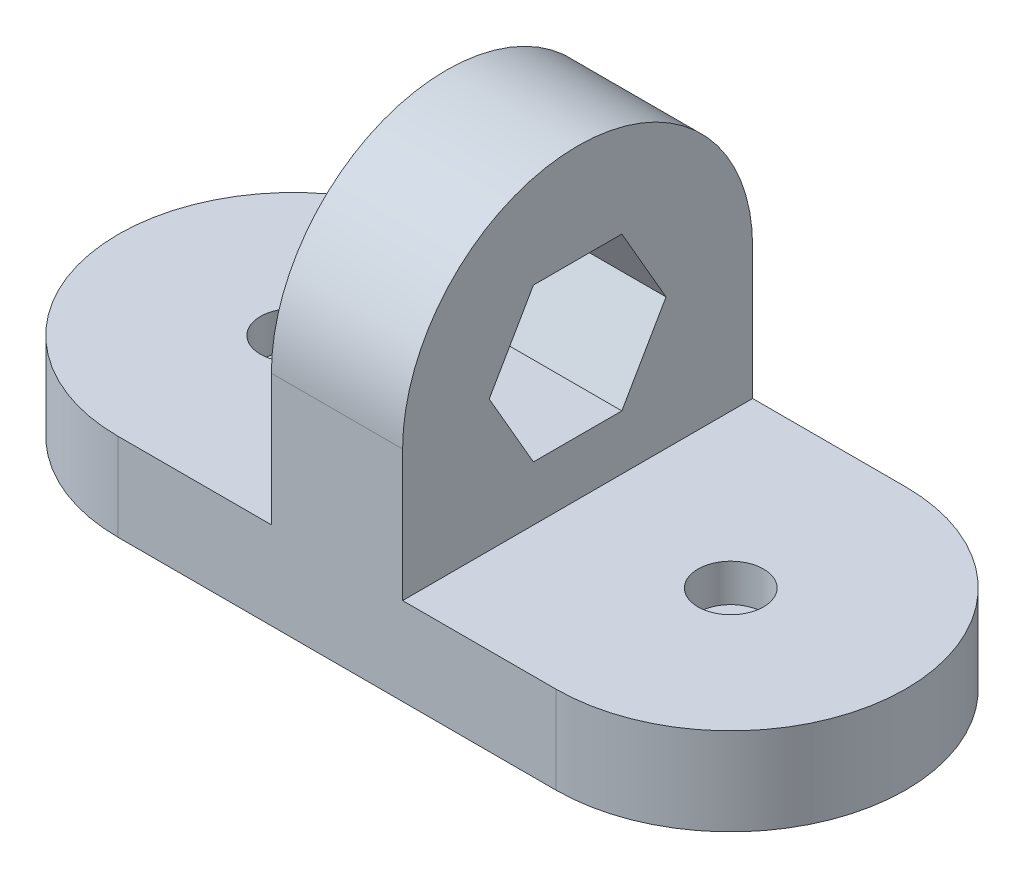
from build123d import *

# Parameters (mm, degrees)
AUFSATZ_LINEAR_AUSTRAGEN1_DEPTH                      = 20
STIRNSENKUNG_F_R_M8_ZYLINDERSCHRAUBE_MIT_D           = 9
STIRNSENKUNG_F_R_M8_ZYLINDERSCHRAUBE_MIT_CBORE_D     = 15
STIRNSENKUNG_F_R_M8_ZYLINDERSCHRAUBE_MIT_CBORE_DEPTH = 8.6
AUFSATZ_LINEAR_AUSTRAGEN2_DEPTH                      = 15
SCHNITT_LINEAR_AUSTRAGEN1_DEPTH                      = 144.961800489


with BuildPart() as part:
    # Skizze1 → Aufsatz-Linear austragen1 (new body)
    with BuildSketch(Plane(origin=(0, 0, 0), x_dir=(1, 0, 0), z_dir=(0, 1, 0))):
        with BuildLine():
            Line((-50, 40), (50, 40))
            ThreePointArc((50, 40), (90, 0), (50, -40))
            Line((50, -40), (-50, -40))
            ThreePointArc((-50, -40), (-90, 0), (-50, 40))
        make_face()
    extrude(amount=AUFSATZ_LINEAR_AUSTRAGEN1_DEPTH)

    # Stirnsenkung f_r M8 Zylinderschraube mit (through all)
    with Locations(Plane(origin=(-50, 20, 0), x_dir=(0, 0, 1), z_dir=(0, 1, 0))):
        with Locations((0, 0), (0, 100)):
            CounterBoreHole(STIRNSENKUNG_F_R_M8_ZYLINDERSCHRAUBE_MIT_D / 2, STIRNSENKUNG_F_R_M8_ZYLINDERSCHRAUBE_MIT_CBORE_D / 2, STIRNSENKUNG_F_R_M8_ZYLINDERSCHRAUBE_MIT_CBORE_DEPTH)

    # Skizze3 → Aufsatz-Linear austragen2 (add, symmetric)
    with BuildSketch(Plane(origin=(0, 0, 0), x_dir=(0, 0, -1), z_dir=(1, 0, 0))):
        with BuildLine():
            Line((-40, 20), (-40, 50))
            ThreePointArc((-40, 50), (0, 90), (40, 50))
            Line((40, 50), (40, 20))
            Line((40, 20), (-40, 20))
        make_face()
    extrude(amount=AUFSATZ_LINEAR_AUSTRAGEN2_DEPTH, both=True)

    # Skizze4 → Schnitt-Linear austragen1 (cut, through all)
    with BuildSketch(Plane.ZY.offset(15)):
        Polygon((10.103629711, 32.5), (20.207259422, 50), (10.103629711, 67.5), (-10.103629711, 67.5), (-20.207259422, 50), (-10.103629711, 32.5), align=None)
    extrude(amount=-SCHNITT_LINEAR_AUSTRAGEN1_DEPTH, mode=Mode.SUBTRACT)


solid = part.part
